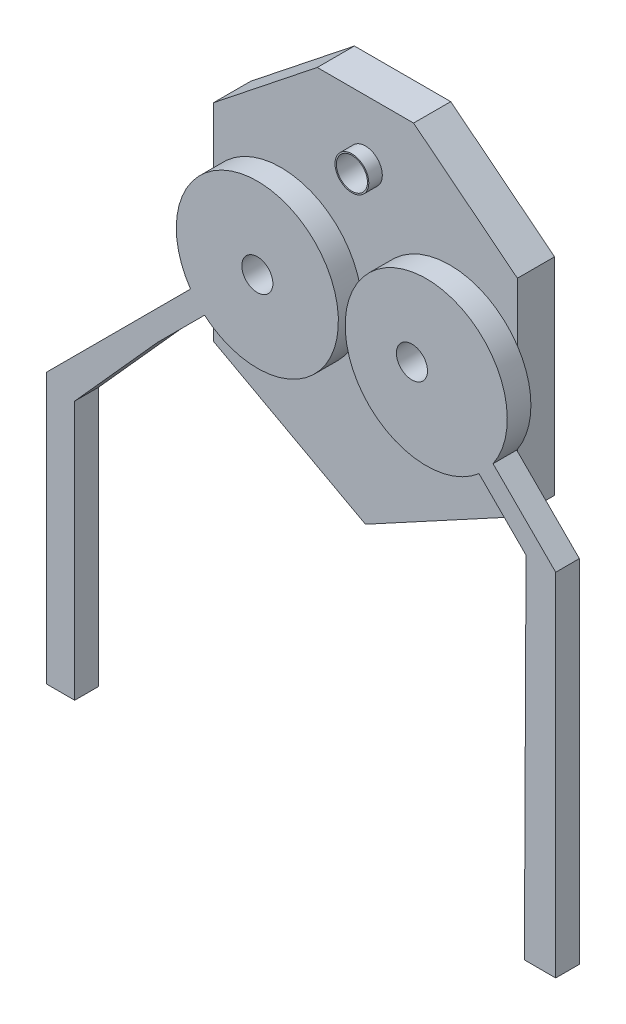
ISO-10303-21;
HEADER;
FILE_DESCRIPTION(('STEP AP214'),'2;1');
FILE_NAME('part.step','',(''),(''),'','','');
FILE_SCHEMA(('AUTOMOTIVE_DESIGN { 1 0 10303 214 1 1 1 1 }'));
ENDSEC;
DATA;
#1=APPLICATION_CONTEXT('core data for automotive mechanical design processes');
#2=APPLICATION_PROTOCOL_DEFINITION('international standard','automotive_design',2000,#1);
#3=PRODUCT_CONTEXT('',#1,'mechanical');
#4=PRODUCT('Part','Part','',(#3));
#5=PRODUCT_RELATED_PRODUCT_CATEGORY('part','',(#4));
#6=PRODUCT_DEFINITION_FORMATION('','',#4);
#7=PRODUCT_DEFINITION_CONTEXT('part definition',#1,'design');
#8=PRODUCT_DEFINITION('design','',#6,#7);
#9=PRODUCT_DEFINITION_SHAPE('','',#8);
#10=(LENGTH_UNIT() NAMED_UNIT(*) SI_UNIT(.MILLI.,.METRE.));
#11=(NAMED_UNIT(*) PLANE_ANGLE_UNIT() SI_UNIT($,.RADIAN.));
#12=(NAMED_UNIT(*) SI_UNIT($,.STERADIAN.) SOLID_ANGLE_UNIT());
#13=UNCERTAINTY_MEASURE_WITH_UNIT(LENGTH_MEASURE(1.E-05),#10,'distance_accuracy_value','');
#14=(GEOMETRIC_REPRESENTATION_CONTEXT(3) GLOBAL_UNCERTAINTY_ASSIGNED_CONTEXT((#13)) GLOBAL_UNIT_ASSIGNED_CONTEXT((#10,
#11,#12)) REPRESENTATION_CONTEXT('',''));
#15=CARTESIAN_POINT('',(0.,0.,0.));
#16=DIRECTION('',(0.,0.,1.));
#17=DIRECTION('',(1.,0.,0.));
#18=AXIS2_PLACEMENT_3D('',#15,#16,#17);
#19=CARTESIAN_POINT('',(0.,-27.5,-11.9622419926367));
#20=DIRECTION('',(0.476874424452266,0.878971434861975,0.));
#21=DIRECTION('',(0.,0.,-1.));
#22=AXIS2_PLACEMENT_3D('',#19,#20,#21);
#23=PLANE('',#22);
#24=DIRECTION('',(0.,0.,1.));
#25=VECTOR('',#24,1.);
#26=CARTESIAN_POINT('',(0.,-27.5,-11.9622419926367));
#27=LINE('',#26,#25);
#28=CARTESIAN_POINT('',(0.,-27.5,-5.5));
#29=VERTEX_POINT('',#28);
#30=CARTESIAN_POINT('',(0.,-27.5,0.));
#31=VERTEX_POINT('',#30);
#32=EDGE_CURVE('E10',#29,#31,#27,.T.);
#33=ORIENTED_EDGE('',*,*,#32,.T.);
#34=DIRECTION('',(-0.878971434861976,0.476874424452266,0.));
#35=VECTOR('',#34,1.);
#36=CARTESIAN_POINT('',(0.,-27.5,0.));
#37=LINE('',#36,#35);
#38=CARTESIAN_POINT('',(-22.5,-15.2929200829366,0.));
#39=VERTEX_POINT('',#38);
#40=EDGE_CURVE('E439',#31,#39,#37,.T.);
#41=ORIENTED_EDGE('',*,*,#40,.T.);
#42=DIRECTION('',(0.,0.,1.));
#43=VECTOR('',#42,1.);
#44=CARTESIAN_POINT('',(-22.5,-15.2929200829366,-26.537467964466));
#45=LINE('',#44,#43);
#46=CARTESIAN_POINT('',(-22.5,-15.2929200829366,-5.5));
#47=VERTEX_POINT('',#46);
#48=EDGE_CURVE('E576',#47,#39,#45,.T.);
#49=ORIENTED_EDGE('',*,*,#48,.F.);
#50=DIRECTION('',(-0.878971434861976,0.476874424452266,0.));
#51=VECTOR('',#50,1.);
#52=CARTESIAN_POINT('',(-11.5268724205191,-21.2462465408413,-5.5));
#53=LINE('',#52,#51);
#54=EDGE_CURVE('E397',#29,#47,#53,.T.);
#55=ORIENTED_EDGE('',*,*,#54,.F.);
#56=EDGE_LOOP('',(#33,#41,#49,#55));
#57=FACE_BOUND('',#56,.T.);
#58=ADVANCED_FACE('F15',(#57),#23,.F.);
#59=CARTESIAN_POINT('',(0.,-27.5,-11.9622419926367));
#60=DIRECTION('',(0.476874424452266,-0.878971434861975,0.));
#61=DIRECTION('',(0.,0.,-1.));
#62=AXIS2_PLACEMENT_3D('',#59,#60,#61);
#63=PLANE('',#62);
#64=DIRECTION('',(0.878971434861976,0.476874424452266,0.));
#65=VECTOR('',#64,1.);
#66=CARTESIAN_POINT('',(11.5268724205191,-21.2462465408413,-5.5));
#67=LINE('',#66,#65);
#68=CARTESIAN_POINT('',(22.5,-15.2929200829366,-5.5));
#69=VERTEX_POINT('',#68);
#70=EDGE_CURVE('E354',#29,#69,#67,.T.);
#71=ORIENTED_EDGE('',*,*,#70,.T.);
#72=DIRECTION('',(0.,0.,1.));
#73=VECTOR('',#72,1.);
#74=CARTESIAN_POINT('',(22.5,-15.2929200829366,-26.537467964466));
#75=LINE('',#74,#73);
#76=CARTESIAN_POINT('',(22.5,-15.2929200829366,0.));
#77=VERTEX_POINT('',#76);
#78=EDGE_CURVE('E372',#69,#77,#75,.T.);
#79=ORIENTED_EDGE('',*,*,#78,.T.);
#80=DIRECTION('',(0.878971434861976,0.476874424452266,0.));
#81=VECTOR('',#80,1.);
#82=CARTESIAN_POINT('',(0.,-27.5,0.));
#83=LINE('',#82,#81);
#84=EDGE_CURVE('E443',#31,#77,#83,.T.);
#85=ORIENTED_EDGE('',*,*,#84,.F.);
#86=ORIENTED_EDGE('',*,*,#32,.F.);
#87=EDGE_LOOP('',(#71,#79,#85,#86));
#88=FACE_BOUND('',#87,.T.);
#89=ADVANCED_FACE('F738',(#88),#63,.T.);
#90=CARTESIAN_POINT('',(12.5,0.,3.5));
#91=DIRECTION('',(0.,0.,-1.));
#92=DIRECTION('',(0.,-1.,0.));
#93=AXIS2_PLACEMENT_3D('',#90,#91,#92);
#94=PLANE('',#93);
#95=DIRECTION('',(0.00471580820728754,0.999988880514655,0.));
#96=VECTOR('',#95,1.);
#97=CARTESIAN_POINT('',(27.0316556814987,-68.0875594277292,3.5));
#98=LINE('',#97,#96);
#99=CARTESIAN_POINT('',(27.0316556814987,-68.0875594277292,3.5));
#100=VERTEX_POINT('',#99);
#101=CARTESIAN_POINT('',(27.2769785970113,-16.0667441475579,3.5));
#102=VERTEX_POINT('',#101);
#103=EDGE_CURVE('E329',#100,#102,#98,.T.);
#104=ORIENTED_EDGE('',*,*,#103,.F.);
#105=DIRECTION('',(-1.,0.,0.));
#106=VECTOR('',#105,1.);
#107=CARTESIAN_POINT('',(31.6696264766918,-68.0875594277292,3.5));
#108=LINE('',#107,#106);
#109=CARTESIAN_POINT('',(31.6696264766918,-68.0875594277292,3.5));
#110=VERTEX_POINT('',#109);
#111=EDGE_CURVE('E26',#110,#100,#108,.T.);
#112=ORIENTED_EDGE('',*,*,#111,.F.);
#113=DIRECTION('',(0.,-1.,0.));
#114=VECTOR('',#113,1.);
#115=CARTESIAN_POINT('',(31.6696264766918,-16.0667441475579,3.5));
#116=LINE('',#115,#114);
#117=CARTESIAN_POINT('',(31.6696264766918,-16.0667441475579,3.5));
#118=VERTEX_POINT('',#117);
#119=EDGE_CURVE('E523',#118,#110,#116,.T.);
#120=ORIENTED_EDGE('',*,*,#119,.F.);
#121=DIRECTION('',(0.707106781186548,-0.707106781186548,0.));
#122=VECTOR('',#121,1.);
#123=CARTESIAN_POINT('',(31.6696264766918,-16.0667441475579,3.5));
#124=LINE('',#123,#122);
#125=CARTESIAN_POINT('',(22.3936848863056,-6.79080255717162,3.5));
#126=VERTEX_POINT('',#125);
#127=EDGE_CURVE('E302',#126,#118,#124,.T.);
#128=ORIENTED_EDGE('',*,*,#127,.F.);
#129=CARTESIAN_POINT('',(12.5,0.,3.5));
#130=DIRECTION('',(0.,0.,-1.));
#131=DIRECTION('',(0.,1.,0.));
#132=AXIS2_PLACEMENT_3D('',#129,#130,#131);
#133=CIRCLE('',#132,12.);
#134=CARTESIAN_POINT('',(20.3158575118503,-9.10562306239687,3.5));
#135=VERTEX_POINT('',#134);
#136=EDGE_CURVE('E294',#135,#126,#133,.T.);
#137=ORIENTED_EDGE('',*,*,#136,.F.);
#138=DIRECTION('',(-0.707106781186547,0.707106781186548,0.));
#139=VECTOR('',#138,1.);
#140=CARTESIAN_POINT('',(27.2769785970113,-16.0667441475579,3.5));
#141=LINE('',#140,#139);
#142=EDGE_CURVE('E299',#102,#135,#141,.T.);
#143=ORIENTED_EDGE('',*,*,#142,.F.);
#144=EDGE_LOOP('',(#104,#112,#120,#128,#137,#143));
#145=FACE_BOUND('',#144,.T.);
#146=CARTESIAN_POINT('',(10.3880983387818,0.246417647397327,3.5));
#147=DIRECTION('',(0.,0.,-1.));
#148=DIRECTION('',(1.,0.,0.));
#149=AXIS2_PLACEMENT_3D('',#146,#147,#148);
#150=CIRCLE('',#149,2.3);
#151=CARTESIAN_POINT('',(12.6880983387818,0.246417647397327,3.5));
#152=VERTEX_POINT('',#151);
#153=EDGE_CURVE('E19',#152,#152,#150,.T.);
#154=ORIENTED_EDGE('',*,*,#153,.T.);
#155=EDGE_LOOP('',(#154));
#156=FACE_BOUND('',#155,.T.);
#157=ADVANCED_FACE('F296',(#145,#156),#94,.F.);
#158=CARTESIAN_POINT('',(31.6696264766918,-68.0875594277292,3.5));
#159=DIRECTION('',(0.,-1.,0.));
#160=DIRECTION('',(0.,0.,-1.));
#161=AXIS2_PLACEMENT_3D('',#158,#159,#160);
#162=PLANE('',#161);
#163=DIRECTION('',(-1.,0.,0.));
#164=VECTOR('',#163,1.);
#165=CARTESIAN_POINT('',(31.6696264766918,-68.0875594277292,0.));
#166=LINE('',#165,#164);
#167=CARTESIAN_POINT('',(31.6696264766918,-68.0875594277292,0.));
#168=VERTEX_POINT('',#167);
#169=CARTESIAN_POINT('',(27.0316556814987,-68.0875594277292,0.));
#170=VERTEX_POINT('',#169);
#171=EDGE_CURVE('E339',#168,#170,#166,.T.);
#172=ORIENTED_EDGE('',*,*,#171,.F.);
#173=DIRECTION('',(0.,0.,-1.));
#174=VECTOR('',#173,1.);
#175=CARTESIAN_POINT('',(31.6696264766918,-68.0875594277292,3.5));
#176=LINE('',#175,#174);
#177=EDGE_CURVE('E527',#110,#168,#176,.T.);
#178=ORIENTED_EDGE('',*,*,#177,.F.);
#179=ORIENTED_EDGE('',*,*,#111,.T.);
#180=DIRECTION('',(0.,0.,-1.));
#181=VECTOR('',#180,1.);
#182=CARTESIAN_POINT('',(27.0316556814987,-68.0875594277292,3.5));
#183=LINE('',#182,#181);
#184=EDGE_CURVE('E367',#100,#170,#183,.T.);
#185=ORIENTED_EDGE('',*,*,#184,.T.);
#186=EDGE_LOOP('',(#172,#178,#179,#185));
#187=FACE_BOUND('',#186,.T.);
#188=ADVANCED_FACE('F817',(#187),#162,.T.);
#189=CARTESIAN_POINT('',(31.6696264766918,-16.0667441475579,3.5));
#190=DIRECTION('',(1.,0.,0.));
#191=DIRECTION('',(0.,1.,0.));
#192=AXIS2_PLACEMENT_3D('',#189,#190,#191);
#193=PLANE('',#192);
#194=DIRECTION('',(0.,-1.,0.));
#195=VECTOR('',#194,1.);
#196=CARTESIAN_POINT('',(31.6696264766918,-16.0667441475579,0.));
#197=LINE('',#196,#195);
#198=CARTESIAN_POINT('',(31.6696264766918,-16.0667441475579,0.));
#199=VERTEX_POINT('',#198);
#200=EDGE_CURVE('E461',#199,#168,#197,.T.);
#201=ORIENTED_EDGE('',*,*,#200,.F.);
#202=DIRECTION('',(0.,0.,-1.));
#203=VECTOR('',#202,1.);
#204=CARTESIAN_POINT('',(31.6696264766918,-16.0667441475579,3.5));
#205=LINE('',#204,#203);
#206=EDGE_CURVE('E528',#118,#199,#205,.T.);
#207=ORIENTED_EDGE('',*,*,#206,.F.);
#208=ORIENTED_EDGE('',*,*,#119,.T.);
#209=ORIENTED_EDGE('',*,*,#177,.T.);
#210=EDGE_LOOP('',(#201,#207,#208,#209));
#211=FACE_BOUND('',#210,.T.);
#212=ADVANCED_FACE('F815',(#211),#193,.T.);
#213=CARTESIAN_POINT('',(31.6696264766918,-16.0667441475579,3.5));
#214=DIRECTION('',(0.707106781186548,0.707106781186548,0.));
#215=DIRECTION('',(0.,0.,-1.));
#216=AXIS2_PLACEMENT_3D('',#213,#214,#215);
#217=PLANE('',#216);
#218=DIRECTION('',(0.707106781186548,-0.707106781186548,0.));
#219=VECTOR('',#218,1.);
#220=CARTESIAN_POINT('',(31.6696264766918,-16.0667441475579,0.));
#221=LINE('',#220,#219);
#222=CARTESIAN_POINT('',(22.3936848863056,-6.79080255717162,0.));
#223=VERTEX_POINT('',#222);
#224=CARTESIAN_POINT('',(22.5,-6.89711767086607,0.));
#225=VERTEX_POINT('',#224);
#226=EDGE_CURVE('E473',#223,#225,#221,.T.);
#227=ORIENTED_EDGE('',*,*,#226,.F.);
#228=DIRECTION('',(0.,0.,-1.));
#229=VECTOR('',#228,1.);
#230=CARTESIAN_POINT('',(22.3936848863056,-6.79080255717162,3.5));
#231=LINE('',#230,#229);
#232=EDGE_CURVE('E306',#126,#223,#231,.T.);
#233=ORIENTED_EDGE('',*,*,#232,.F.);
#234=ORIENTED_EDGE('',*,*,#127,.T.);
#235=ORIENTED_EDGE('',*,*,#206,.T.);
#236=DIRECTION('',(0.707106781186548,-0.707106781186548,0.));
#237=VECTOR('',#236,1.);
#238=CARTESIAN_POINT('',(31.6696264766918,-16.0667441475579,0.));
#239=LINE('',#238,#237);
#240=EDGE_CURVE('E457',#225,#199,#239,.T.);
#241=ORIENTED_EDGE('',*,*,#240,.F.);
#242=EDGE_LOOP('',(#227,#233,#234,#235,#241));
#243=FACE_BOUND('',#242,.T.);
#244=ADVANCED_FACE('F811',(#243),#217,.T.);
#245=CARTESIAN_POINT('',(12.5,0.,3.5));
#246=DIRECTION('',(0.,0.,-1.));
#247=DIRECTION('',(-1.,0.,0.));
#248=AXIS2_PLACEMENT_3D('',#245,#246,#247);
#249=CYLINDRICAL_SURFACE('',#248,12.);
#250=CARTESIAN_POINT('',(12.5,0.,0.));
#251=DIRECTION('',(0.,0.,-1.));
#252=DIRECTION('',(0.,1.,0.));
#253=AXIS2_PLACEMENT_3D('',#250,#251,#252);
#254=CIRCLE('',#253,12.);
#255=CARTESIAN_POINT('',(20.3158575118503,-9.10562306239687,0.));
#256=VERTEX_POINT('',#255);
#257=CARTESIAN_POINT('',(22.5,6.63324958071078,0.));
#258=VERTEX_POINT('',#257);
#259=EDGE_CURVE('E312',#256,#258,#254,.T.);
#260=ORIENTED_EDGE('',*,*,#259,.F.);
#261=DIRECTION('',(0.,0.,-1.));
#262=VECTOR('',#261,1.);
#263=CARTESIAN_POINT('',(20.3158575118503,-9.10562306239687,3.5));
#264=LINE('',#263,#262);
#265=EDGE_CURVE('E307',#135,#256,#264,.T.);
#266=ORIENTED_EDGE('',*,*,#265,.F.);
#267=ORIENTED_EDGE('',*,*,#136,.T.);
#268=ORIENTED_EDGE('',*,*,#232,.T.);
#269=CARTESIAN_POINT('',(12.5,0.,0.));
#270=DIRECTION('',(0.,0.,-1.));
#271=DIRECTION('',(0.,1.,0.));
#272=AXIS2_PLACEMENT_3D('',#269,#270,#271);
#273=CIRCLE('',#272,12.);
#274=CARTESIAN_POINT('',(22.5,-6.63324958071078,0.));
#275=VERTEX_POINT('',#274);
#276=EDGE_CURVE('E448',#275,#223,#273,.T.);
#277=ORIENTED_EDGE('',*,*,#276,.F.);
#278=CARTESIAN_POINT('',(12.5,0.,0.));
#279=DIRECTION('',(0.,0.,-1.));
#280=DIRECTION('',(0.,1.,0.));
#281=AXIS2_PLACEMENT_3D('',#278,#279,#280);
#282=CIRCLE('',#281,12.);
#283=EDGE_CURVE('E338',#258,#275,#282,.T.);
#284=ORIENTED_EDGE('',*,*,#283,.F.);
#285=EDGE_LOOP('',(#260,#266,#267,#268,#277,#284));
#286=FACE_BOUND('',#285,.T.);
#287=ADVANCED_FACE('F310',(#286),#249,.T.);
#288=CARTESIAN_POINT('',(27.2769785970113,-16.0667441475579,3.5));
#289=DIRECTION('',(-0.707106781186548,-0.707106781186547,0.));
#290=DIRECTION('',(-0.707106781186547,0.707106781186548,0.));
#291=AXIS2_PLACEMENT_3D('',#288,#289,#290);
#292=PLANE('',#291);
#293=DIRECTION('',(-0.707106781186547,0.707106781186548,0.));
#294=VECTOR('',#293,1.);
#295=CARTESIAN_POINT('',(27.2769785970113,-16.0667441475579,0.));
#296=LINE('',#295,#294);
#297=CARTESIAN_POINT('',(27.2769785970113,-16.0667441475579,0.));
#298=VERTEX_POINT('',#297);
#299=CARTESIAN_POINT('',(22.5,-11.2897655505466,0.));
#300=VERTEX_POINT('',#299);
#301=EDGE_CURVE('E462',#298,#300,#296,.T.);
#302=ORIENTED_EDGE('',*,*,#301,.F.);
#303=DIRECTION('',(0.,0.,-1.));
#304=VECTOR('',#303,1.);
#305=CARTESIAN_POINT('',(27.2769785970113,-16.0667441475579,3.5));
#306=LINE('',#305,#304);
#307=EDGE_CURVE('E321',#102,#298,#306,.T.);
#308=ORIENTED_EDGE('',*,*,#307,.F.);
#309=ORIENTED_EDGE('',*,*,#142,.T.);
#310=ORIENTED_EDGE('',*,*,#265,.T.);
#311=DIRECTION('',(-0.707106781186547,0.707106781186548,0.));
#312=VECTOR('',#311,1.);
#313=CARTESIAN_POINT('',(27.2769785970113,-16.0667441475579,0.));
#314=LINE('',#313,#312);
#315=EDGE_CURVE('E412',#300,#256,#314,.T.);
#316=ORIENTED_EDGE('',*,*,#315,.F.);
#317=EDGE_LOOP('',(#302,#308,#309,#310,#316));
#318=FACE_BOUND('',#317,.T.);
#319=ADVANCED_FACE('F319',(#318),#292,.T.);
#320=CARTESIAN_POINT('',(27.0316556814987,-68.0875594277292,3.5));
#321=DIRECTION('',(-0.999988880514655,0.00471580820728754,0.));
#322=DIRECTION('',(0.,0.,1.));
#323=AXIS2_PLACEMENT_3D('',#320,#321,#322);
#324=PLANE('',#323);
#325=DIRECTION('',(0.00471580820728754,0.999988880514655,0.));
#326=VECTOR('',#325,1.);
#327=CARTESIAN_POINT('',(27.0316556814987,-68.0875594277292,0.));
#328=LINE('',#327,#326);
#329=EDGE_CURVE('E334',#170,#298,#328,.T.);
#330=ORIENTED_EDGE('',*,*,#329,.F.);
#331=ORIENTED_EDGE('',*,*,#184,.F.);
#332=ORIENTED_EDGE('',*,*,#103,.T.);
#333=ORIENTED_EDGE('',*,*,#307,.T.);
#334=EDGE_LOOP('',(#330,#331,#332,#333));
#335=FACE_BOUND('',#334,.T.);
#336=ADVANCED_FACE('F17',(#335),#324,.T.);
#337=CARTESIAN_POINT('',(12.5,0.,0.));
#338=DIRECTION('',(0.,0.,-1.));
#339=DIRECTION('',(0.,-1.,0.));
#340=AXIS2_PLACEMENT_3D('',#337,#338,#339);
#341=PLANE('',#340);
#342=CARTESIAN_POINT('',(10.3880983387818,0.246417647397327,0.));
#343=DIRECTION('',(0.,0.,-1.));
#344=DIRECTION('',(1.,0.,0.));
#345=AXIS2_PLACEMENT_3D('',#342,#343,#344);
#346=CIRCLE('',#345,2.3);
#347=CARTESIAN_POINT('',(12.5346048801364,1.07255908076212,0.));
#348=VERTEX_POINT('',#347);
#349=CARTESIAN_POINT('',(8.35349345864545,-0.826141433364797,0.));
#350=VERTEX_POINT('',#349);
#351=EDGE_CURVE('E388',#348,#350,#346,.T.);
#352=ORIENTED_EDGE('',*,*,#351,.F.);
#353=CARTESIAN_POINT('',(10.5,0.,0.));
#354=DIRECTION('',(0.,0.,-1.));
#355=DIRECTION('',(1.,0.,0.));
#356=AXIS2_PLACEMENT_3D('',#353,#354,#355);
#357=CIRCLE('',#356,2.3);
#358=EDGE_CURVE('E474',#348,#350,#357,.T.);
#359=ORIENTED_EDGE('',*,*,#358,.T.);
#360=EDGE_LOOP('',(#352,#359));
#361=FACE_BOUND('',#360,.T.);
#362=ADVANCED_FACE('F842',(#361),#341,.T.);
#363=CARTESIAN_POINT('',(12.5,0.,0.));
#364=DIRECTION('',(0.,0.,-1.));
#365=DIRECTION('',(0.,-1.,0.));
#366=AXIS2_PLACEMENT_3D('',#363,#364,#365);
#367=PLANE('',#366);
#368=ORIENTED_EDGE('',*,*,#283,.T.);
#369=DIRECTION('',(0.,1.,0.));
#370=VECTOR('',#369,1.);
#371=CARTESIAN_POINT('',(22.5,-27.5,0.));
#372=LINE('',#371,#370);
#373=EDGE_CURVE('E371',#275,#258,#372,.T.);
#374=ORIENTED_EDGE('',*,*,#373,.T.);
#375=EDGE_LOOP('',(#368,#374));
#376=FACE_BOUND('',#375,.T.);
#377=ADVANCED_FACE('F845',(#376),#367,.T.);
#378=CARTESIAN_POINT('',(12.5,0.,0.));
#379=DIRECTION('',(0.,0.,-1.));
#380=DIRECTION('',(0.,-1.,0.));
#381=AXIS2_PLACEMENT_3D('',#378,#379,#380);
#382=PLANE('',#381);
#383=ORIENTED_EDGE('',*,*,#301,.T.);
#384=DIRECTION('',(0.,1.,0.));
#385=VECTOR('',#384,1.);
#386=CARTESIAN_POINT('',(22.5,-27.5,0.));
#387=LINE('',#386,#385);
#388=EDGE_CURVE('E463',#300,#225,#387,.T.);
#389=ORIENTED_EDGE('',*,*,#388,.T.);
#390=ORIENTED_EDGE('',*,*,#240,.T.);
#391=ORIENTED_EDGE('',*,*,#200,.T.);
#392=ORIENTED_EDGE('',*,*,#171,.T.);
#393=ORIENTED_EDGE('',*,*,#329,.T.);
#394=EDGE_LOOP('',(#383,#389,#390,#391,#392,#393));
#395=FACE_BOUND('',#394,.T.);
#396=ADVANCED_FACE('F784',(#395),#382,.T.);
#397=CARTESIAN_POINT('',(12.5,0.,0.));
#398=DIRECTION('',(0.,0.,-1.));
#399=DIRECTION('',(0.,-1.,0.));
#400=AXIS2_PLACEMENT_3D('',#397,#398,#399);
#401=PLANE('',#400);
#402=CARTESIAN_POINT('',(19.6896963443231,0.,0.));
#403=DIRECTION('',(0.,0.,-1.));
#404=DIRECTION('',(1.,0.,0.));
#405=AXIS2_PLACEMENT_3D('',#402,#403,#404);
#406=CIRCLE('',#405,1.);
#407=CARTESIAN_POINT('',(20.6896963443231,0.,0.));
#408=VERTEX_POINT('',#407);
#409=EDGE_CURVE('E532',#408,#408,#406,.T.);
#410=ORIENTED_EDGE('',*,*,#409,.T.);
#411=EDGE_LOOP('',(#410));
#412=FACE_BOUND('',#411,.T.);
#413=ADVANCED_FACE('F889',(#412),#401,.T.);
#414=CARTESIAN_POINT('',(-12.5,0.,0.));
#415=DIRECTION('',(0.,0.,1.));
#416=DIRECTION('',(1.,0.,0.));
#417=AXIS2_PLACEMENT_3D('',#414,#415,#416);
#418=PLANE('',#417);
#419=DIRECTION('',(-0.707106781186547,-0.707106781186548,0.));
#420=VECTOR('',#419,1.);
#421=CARTESIAN_POINT('',(-31.6696264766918,-16.0667441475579,0.));
#422=LINE('',#421,#420);
#423=CARTESIAN_POINT('',(-22.5,-6.89711767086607,0.));
#424=VERTEX_POINT('',#423);
#425=CARTESIAN_POINT('',(-43.6904417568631,-28.0875594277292,0.));
#426=VERTEX_POINT('',#425);
#427=EDGE_CURVE('E411',#424,#426,#422,.T.);
#428=ORIENTED_EDGE('',*,*,#427,.F.);
#429=DIRECTION('',(0.,-1.,0.));
#430=VECTOR('',#429,1.);
#431=CARTESIAN_POINT('',(-22.5,27.5,0.));
#432=LINE('',#431,#430);
#433=CARTESIAN_POINT('',(-22.5,-11.2897655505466,0.));
#434=VERTEX_POINT('',#433);
#435=EDGE_CURVE('E574',#424,#434,#432,.T.);
#436=ORIENTED_EDGE('',*,*,#435,.T.);
#437=DIRECTION('',(0.707106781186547,0.707106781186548,0.));
#438=VECTOR('',#437,1.);
#439=CARTESIAN_POINT('',(-27.2769785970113,-16.0667441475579,0.));
#440=LINE('',#439,#438);
#441=CARTESIAN_POINT('',(-27.2769785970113,-16.0667441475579,0.));
#442=VERTEX_POINT('',#441);
#443=EDGE_CURVE('E279',#442,#434,#440,.T.);
#444=ORIENTED_EDGE('',*,*,#443,.F.);
#445=DIRECTION('',(0.667952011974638,0.744204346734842,0.));
#446=VECTOR('',#445,1.);
#447=CARTESIAN_POINT('',(-27.2769785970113,-16.0667441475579,0.));
#448=LINE('',#447,#446);
#449=CARTESIAN_POINT('',(-39.5380625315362,-29.7275338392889,0.));
#450=VERTEX_POINT('',#449);
#451=EDGE_CURVE('E517',#450,#442,#448,.T.);
#452=ORIENTED_EDGE('',*,*,#451,.F.);
#453=DIRECTION('',(0.,1.,0.));
#454=VECTOR('',#453,1.);
#455=CARTESIAN_POINT('',(-39.5380625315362,-29.7275338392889,0.));
#456=LINE('',#455,#454);
#457=CARTESIAN_POINT('',(-39.5380625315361,-68.0875594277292,0.));
#458=VERTEX_POINT('',#457);
#459=EDGE_CURVE('E433',#458,#450,#456,.T.);
#460=ORIENTED_EDGE('',*,*,#459,.F.);
#461=DIRECTION('',(1.,0.,0.));
#462=VECTOR('',#461,1.);
#463=CARTESIAN_POINT('',(-39.5380625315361,-68.0875594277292,0.));
#464=LINE('',#463,#462);
#465=CARTESIAN_POINT('',(-43.6904417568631,-68.0875594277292,0.));
#466=VERTEX_POINT('',#465);
#467=EDGE_CURVE('E383',#466,#458,#464,.T.);
#468=ORIENTED_EDGE('',*,*,#467,.F.);
#469=DIRECTION('',(0.,-1.,0.));
#470=VECTOR('',#469,1.);
#471=CARTESIAN_POINT('',(-43.6904417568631,-28.0875594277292,0.));
#472=LINE('',#471,#470);
#473=EDGE_CURVE('E453',#426,#466,#472,.T.);
#474=ORIENTED_EDGE('',*,*,#473,.F.);
#475=EDGE_LOOP('',(#428,#436,#444,#452,#460,#468,#474));
#476=FACE_BOUND('',#475,.T.);
#477=ADVANCED_FACE('F949',(#476),#418,.F.);
#478=CARTESIAN_POINT('',(-12.5,0.,3.5));
#479=DIRECTION('',(0.,0.,1.));
#480=DIRECTION('',(1.,0.,0.));
#481=AXIS2_PLACEMENT_3D('',#478,#479,#480);
#482=PLANE('',#481);
#483=DIRECTION('',(0.667952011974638,0.744204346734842,0.));
#484=VECTOR('',#483,1.);
#485=CARTESIAN_POINT('',(-27.2769785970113,-16.0667441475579,3.5));
#486=LINE('',#485,#484);
#487=CARTESIAN_POINT('',(-39.5380625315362,-29.7275338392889,3.5));
#488=VERTEX_POINT('',#487);
#489=CARTESIAN_POINT('',(-27.2769785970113,-16.0667441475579,3.5));
#490=VERTEX_POINT('',#489);
#491=EDGE_CURVE('E359',#488,#490,#486,.T.);
#492=ORIENTED_EDGE('',*,*,#491,.T.);
#493=DIRECTION('',(0.707106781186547,0.707106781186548,0.));
#494=VECTOR('',#493,1.);
#495=CARTESIAN_POINT('',(-27.2769785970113,-16.0667441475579,3.5));
#496=LINE('',#495,#494);
#497=CARTESIAN_POINT('',(-20.3158575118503,-9.10562306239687,3.5));
#498=VERTEX_POINT('',#497);
#499=EDGE_CURVE('E268',#490,#498,#496,.T.);
#500=ORIENTED_EDGE('',*,*,#499,.T.);
#501=CARTESIAN_POINT('',(-12.5,0.,3.5));
#502=DIRECTION('',(0.,0.,1.));
#503=DIRECTION('',(-1.,0.,0.));
#504=AXIS2_PLACEMENT_3D('',#501,#502,#503);
#505=CIRCLE('',#504,12.);
#506=CARTESIAN_POINT('',(-22.3936848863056,-6.79080255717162,3.5));
#507=VERTEX_POINT('',#506);
#508=EDGE_CURVE('E677',#498,#507,#505,.T.);
#509=ORIENTED_EDGE('',*,*,#508,.T.);
#510=DIRECTION('',(-0.707106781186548,-0.707106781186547,0.));
#511=VECTOR('',#510,1.);
#512=CARTESIAN_POINT('',(-31.6696264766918,-16.0667441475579,3.5));
#513=LINE('',#512,#511);
#514=CARTESIAN_POINT('',(-43.6904417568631,-28.0875594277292,3.5));
#515=VERTEX_POINT('',#514);
#516=EDGE_CURVE('E410',#507,#515,#513,.T.);
#517=ORIENTED_EDGE('',*,*,#516,.T.);
#518=DIRECTION('',(0.,-1.,0.));
#519=VECTOR('',#518,1.);
#520=CARTESIAN_POINT('',(-43.6904417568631,-28.0875594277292,3.5));
#521=LINE('',#520,#519);
#522=CARTESIAN_POINT('',(-43.6904417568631,-68.0875594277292,3.5));
#523=VERTEX_POINT('',#522);
#524=EDGE_CURVE('E379',#515,#523,#521,.T.);
#525=ORIENTED_EDGE('',*,*,#524,.T.);
#526=DIRECTION('',(1.,0.,0.));
#527=VECTOR('',#526,1.);
#528=CARTESIAN_POINT('',(-39.5380625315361,-68.0875594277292,3.5));
#529=LINE('',#528,#527);
#530=CARTESIAN_POINT('',(-39.5380625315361,-68.0875594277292,3.5));
#531=VERTEX_POINT('',#530);
#532=EDGE_CURVE('E429',#523,#531,#529,.T.);
#533=ORIENTED_EDGE('',*,*,#532,.T.);
#534=DIRECTION('',(0.,1.,0.));
#535=VECTOR('',#534,1.);
#536=CARTESIAN_POINT('',(-39.5380625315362,-29.7275338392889,3.5));
#537=LINE('',#536,#535);
#538=EDGE_CURVE('E564',#531,#488,#537,.T.);
#539=ORIENTED_EDGE('',*,*,#538,.T.);
#540=EDGE_LOOP('',(#492,#500,#509,#517,#525,#533,#539));
#541=FACE_BOUND('',#540,.T.);
#542=CARTESIAN_POINT('',(-12.5,0.,3.5));
#543=DIRECTION('',(0.,0.,-1.));
#544=DIRECTION('',(1.,0.,0.));
#545=AXIS2_PLACEMENT_3D('',#542,#543,#544);
#546=CIRCLE('',#545,2.3);
#547=CARTESIAN_POINT('',(-10.2,0.,3.5));
#548=VERTEX_POINT('',#547);
#549=EDGE_CURVE('E434',#548,#548,#546,.T.);
#550=ORIENTED_EDGE('',*,*,#549,.T.);
#551=EDGE_LOOP('',(#550));
#552=FACE_BOUND('',#551,.T.);
#553=ADVANCED_FACE('F840',(#541,#552),#482,.T.);
#554=CARTESIAN_POINT('',(-39.5380625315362,-29.7275338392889,3.5));
#555=DIRECTION('',(-1.,0.,0.));
#556=DIRECTION('',(0.,1.,0.));
#557=AXIS2_PLACEMENT_3D('',#554,#555,#556);
#558=PLANE('',#557);
#559=ORIENTED_EDGE('',*,*,#459,.T.);
#560=DIRECTION('',(0.,0.,-1.));
#561=VECTOR('',#560,1.);
#562=CARTESIAN_POINT('',(-39.5380625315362,-29.7275338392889,3.5));
#563=LINE('',#562,#561);
#564=EDGE_CURVE('E343',#488,#450,#563,.T.);
#565=ORIENTED_EDGE('',*,*,#564,.F.);
#566=ORIENTED_EDGE('',*,*,#538,.F.);
#567=DIRECTION('',(0.,0.,-1.));
#568=VECTOR('',#567,1.);
#569=CARTESIAN_POINT('',(-39.5380625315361,-68.0875594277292,3.5));
#570=LINE('',#569,#568);
#571=EDGE_CURVE('E387',#531,#458,#570,.T.);
#572=ORIENTED_EDGE('',*,*,#571,.T.);
#573=EDGE_LOOP('',(#559,#565,#566,#572));
#574=FACE_BOUND('',#573,.T.);
#575=ADVANCED_FACE('F836',(#574),#558,.F.);
#576=CARTESIAN_POINT('',(-39.5380625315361,-68.0875594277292,3.5));
#577=DIRECTION('',(0.,1.,0.));
#578=DIRECTION('',(1.,0.,0.));
#579=AXIS2_PLACEMENT_3D('',#576,#577,#578);
#580=PLANE('',#579);
#581=ORIENTED_EDGE('',*,*,#467,.T.);
#582=ORIENTED_EDGE('',*,*,#571,.F.);
#583=ORIENTED_EDGE('',*,*,#532,.F.);
#584=DIRECTION('',(0.,0.,-1.));
#585=VECTOR('',#584,1.);
#586=CARTESIAN_POINT('',(-43.6904417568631,-68.0875594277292,3.5));
#587=LINE('',#586,#585);
#588=EDGE_CURVE('E333',#523,#466,#587,.T.);
#589=ORIENTED_EDGE('',*,*,#588,.T.);
#590=EDGE_LOOP('',(#581,#582,#583,#589));
#591=FACE_BOUND('',#590,.T.);
#592=ADVANCED_FACE('F839',(#591),#580,.F.);
#593=CARTESIAN_POINT('',(-43.6904417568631,-28.0875594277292,3.5));
#594=DIRECTION('',(1.,0.,0.));
#595=DIRECTION('',(0.,1.,0.));
#596=AXIS2_PLACEMENT_3D('',#593,#594,#595);
#597=PLANE('',#596);
#598=ORIENTED_EDGE('',*,*,#473,.T.);
#599=ORIENTED_EDGE('',*,*,#588,.F.);
#600=ORIENTED_EDGE('',*,*,#524,.F.);
#601=DIRECTION('',(0.,0.,-1.));
#602=VECTOR('',#601,1.);
#603=CARTESIAN_POINT('',(-43.6904417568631,-28.0875594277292,3.5));
#604=LINE('',#603,#602);
#605=EDGE_CURVE('E406',#515,#426,#604,.T.);
#606=ORIENTED_EDGE('',*,*,#605,.T.);
#607=EDGE_LOOP('',(#598,#599,#600,#606));
#608=FACE_BOUND('',#607,.T.);
#609=ADVANCED_FACE('F861',(#608),#597,.F.);
#610=CARTESIAN_POINT('',(-31.6696264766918,-16.0667441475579,3.5));
#611=DIRECTION('',(0.707106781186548,-0.707106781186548,0.));
#612=DIRECTION('',(0.,0.,-1.));
#613=AXIS2_PLACEMENT_3D('',#610,#611,#612);
#614=PLANE('',#613);
#615=DIRECTION('',(-0.707106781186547,-0.707106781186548,0.));
#616=VECTOR('',#615,1.);
#617=CARTESIAN_POINT('',(-31.6696264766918,-16.0667441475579,0.));
#618=LINE('',#617,#616);
#619=CARTESIAN_POINT('',(-22.3936848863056,-6.79080255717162,0.));
#620=VERTEX_POINT('',#619);
#621=EDGE_CURVE('E472',#620,#424,#618,.T.);
#622=ORIENTED_EDGE('',*,*,#621,.T.);
#623=ORIENTED_EDGE('',*,*,#427,.T.);
#624=ORIENTED_EDGE('',*,*,#605,.F.);
#625=ORIENTED_EDGE('',*,*,#516,.F.);
#626=DIRECTION('',(0.,0.,-1.));
#627=VECTOR('',#626,1.);
#628=CARTESIAN_POINT('',(-22.3936848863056,-6.79080255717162,3.5));
#629=LINE('',#628,#627);
#630=EDGE_CURVE('E688',#507,#620,#629,.T.);
#631=ORIENTED_EDGE('',*,*,#630,.T.);
#632=EDGE_LOOP('',(#622,#623,#624,#625,#631));
#633=FACE_BOUND('',#632,.T.);
#634=ADVANCED_FACE('F955',(#633),#614,.F.);
#635=CARTESIAN_POINT('',(-12.5,0.,3.5));
#636=DIRECTION('',(0.,0.,-1.));
#637=DIRECTION('',(-1.,0.,0.));
#638=AXIS2_PLACEMENT_3D('',#635,#636,#637);
#639=CYLINDRICAL_SURFACE('',#638,12.);
#640=CARTESIAN_POINT('',(-12.5,0.,0.));
#641=DIRECTION('',(0.,0.,1.));
#642=DIRECTION('',(-1.,0.,0.));
#643=AXIS2_PLACEMENT_3D('',#640,#641,#642);
#644=CIRCLE('',#643,12.);
#645=CARTESIAN_POINT('',(-20.3158575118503,-9.10562306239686,0.));
#646=VERTEX_POINT('',#645);
#647=CARTESIAN_POINT('',(-22.5,6.63324958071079,0.));
#648=VERTEX_POINT('',#647);
#649=EDGE_CURVE('E428',#646,#648,#644,.T.);
#650=ORIENTED_EDGE('',*,*,#649,.T.);
#651=CARTESIAN_POINT('',(-12.5,0.,0.));
#652=DIRECTION('',(0.,0.,1.));
#653=DIRECTION('',(-1.,0.,0.));
#654=AXIS2_PLACEMENT_3D('',#651,#652,#653);
#655=CIRCLE('',#654,12.);
#656=CARTESIAN_POINT('',(-22.5,-6.63324958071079,0.));
#657=VERTEX_POINT('',#656);
#658=EDGE_CURVE('E522',#648,#657,#655,.T.);
#659=ORIENTED_EDGE('',*,*,#658,.T.);
#660=CARTESIAN_POINT('',(-12.5,0.,0.));
#661=DIRECTION('',(0.,0.,1.));
#662=DIRECTION('',(-1.,0.,0.));
#663=AXIS2_PLACEMENT_3D('',#660,#661,#662);
#664=CIRCLE('',#663,12.);
#665=EDGE_CURVE('E483',#657,#620,#664,.T.);
#666=ORIENTED_EDGE('',*,*,#665,.T.);
#667=ORIENTED_EDGE('',*,*,#630,.F.);
#668=ORIENTED_EDGE('',*,*,#508,.F.);
#669=DIRECTION('',(0.,0.,-1.));
#670=VECTOR('',#669,1.);
#671=CARTESIAN_POINT('',(-20.3158575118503,-9.10562306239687,3.5));
#672=LINE('',#671,#670);
#673=EDGE_CURVE('E342',#498,#646,#672,.T.);
#674=ORIENTED_EDGE('',*,*,#673,.T.);
#675=EDGE_LOOP('',(#650,#659,#666,#667,#668,#674));
#676=FACE_BOUND('',#675,.T.);
#677=ADVANCED_FACE('F963',(#676),#639,.T.);
#678=CARTESIAN_POINT('',(-27.2769785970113,-16.0667441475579,3.5));
#679=DIRECTION('',(-0.707106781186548,0.707106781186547,0.));
#680=DIRECTION('',(0.,0.,1.));
#681=AXIS2_PLACEMENT_3D('',#678,#679,#680);
#682=PLANE('',#681);
#683=ORIENTED_EDGE('',*,*,#443,.T.);
#684=DIRECTION('',(0.707106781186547,0.707106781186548,0.));
#685=VECTOR('',#684,1.);
#686=CARTESIAN_POINT('',(-27.2769785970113,-16.0667441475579,0.));
#687=LINE('',#686,#685);
#688=EDGE_CURVE('E423',#434,#646,#687,.T.);
#689=ORIENTED_EDGE('',*,*,#688,.T.);
#690=ORIENTED_EDGE('',*,*,#673,.F.);
#691=ORIENTED_EDGE('',*,*,#499,.F.);
#692=DIRECTION('',(0.,0.,-1.));
#693=VECTOR('',#692,1.);
#694=CARTESIAN_POINT('',(-27.2769785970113,-16.0667441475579,3.5));
#695=LINE('',#694,#693);
#696=EDGE_CURVE('E521',#490,#442,#695,.T.);
#697=ORIENTED_EDGE('',*,*,#696,.T.);
#698=EDGE_LOOP('',(#683,#689,#690,#691,#697));
#699=FACE_BOUND('',#698,.T.);
#700=ADVANCED_FACE('F1344',(#699),#682,.F.);
#701=CARTESIAN_POINT('',(-27.2769785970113,-16.0667441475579,3.5));
#702=DIRECTION('',(-0.744204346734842,0.667952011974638,0.));
#703=DIRECTION('',(0.,0.,1.));
#704=AXIS2_PLACEMENT_3D('',#701,#702,#703);
#705=PLANE('',#704);
#706=ORIENTED_EDGE('',*,*,#451,.T.);
#707=ORIENTED_EDGE('',*,*,#696,.F.);
#708=ORIENTED_EDGE('',*,*,#491,.F.);
#709=ORIENTED_EDGE('',*,*,#564,.T.);
#710=EDGE_LOOP('',(#706,#707,#708,#709));
#711=FACE_BOUND('',#710,.T.);
#712=ADVANCED_FACE('F930',(#711),#705,.F.);
#713=CARTESIAN_POINT('',(-12.5,0.,0.));
#714=DIRECTION('',(0.,0.,1.));
#715=DIRECTION('',(1.,0.,0.));
#716=AXIS2_PLACEMENT_3D('',#713,#714,#715);
#717=PLANE('',#716);
#718=ORIENTED_EDGE('',*,*,#658,.F.);
#719=DIRECTION('',(0.,-1.,0.));
#720=VECTOR('',#719,1.);
#721=CARTESIAN_POINT('',(-22.5,27.5,0.));
#722=LINE('',#721,#720);
#723=EDGE_CURVE('E401',#648,#657,#722,.T.);
#724=ORIENTED_EDGE('',*,*,#723,.T.);
#725=EDGE_LOOP('',(#718,#724));
#726=FACE_BOUND('',#725,.T.);
#727=ADVANCED_FACE('F886',(#726),#717,.F.);
#728=CARTESIAN_POINT('',(-12.5,0.,0.));
#729=DIRECTION('',(0.,0.,1.));
#730=DIRECTION('',(1.,0.,0.));
#731=AXIS2_PLACEMENT_3D('',#728,#729,#730);
#732=PLANE('',#731);
#733=CARTESIAN_POINT('',(-8.61030365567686,0.,0.));
#734=DIRECTION('',(0.,0.,-1.));
#735=DIRECTION('',(1.,0.,0.));
#736=AXIS2_PLACEMENT_3D('',#733,#734,#735);
#737=CIRCLE('',#736,1.);
#738=CARTESIAN_POINT('',(-7.61030365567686,0.,0.));
#739=VERTEX_POINT('',#738);
#740=EDGE_CURVE('E405',#739,#739,#737,.T.);
#741=ORIENTED_EDGE('',*,*,#740,.T.);
#742=EDGE_LOOP('',(#741));
#743=FACE_BOUND('',#742,.T.);
#744=ADVANCED_FACE('F883',(#743),#732,.F.);
#745=CARTESIAN_POINT('',(0.,18.5,2.));
#746=DIRECTION('',(0.,0.,-1.));
#747=DIRECTION('',(0.,-1.,0.));
#748=AXIS2_PLACEMENT_3D('',#745,#746,#747);
#749=PLANE('',#748);
#750=CARTESIAN_POINT('',(0.,18.5,2.));
#751=DIRECTION('',(0.,0.,-1.));
#752=DIRECTION('',(0.,1.,0.));
#753=AXIS2_PLACEMENT_3D('',#750,#751,#752);
#754=CIRCLE('',#753,2.5);
#755=CARTESIAN_POINT('',(0.,21.,2.));
#756=VERTEX_POINT('',#755);
#757=EDGE_CURVE('E558',#756,#756,#754,.T.);
#758=ORIENTED_EDGE('',*,*,#757,.F.);
#759=EDGE_LOOP('',(#758));
#760=FACE_BOUND('',#759,.T.);
#761=CARTESIAN_POINT('',(0.,18.5,2.));
#762=DIRECTION('',(0.,0.,-1.));
#763=DIRECTION('',(0.,1.,0.));
#764=AXIS2_PLACEMENT_3D('',#761,#762,#763);
#765=CIRCLE('',#764,2.3);
#766=CARTESIAN_POINT('',(0.,20.8,2.));
#767=VERTEX_POINT('',#766);
#768=EDGE_CURVE('E437',#767,#767,#765,.T.);
#769=ORIENTED_EDGE('',*,*,#768,.T.);
#770=EDGE_LOOP('',(#769));
#771=FACE_BOUND('',#770,.T.);
#772=ADVANCED_FACE('F857',(#760,#771),#749,.F.);
#773=CARTESIAN_POINT('',(0.,18.5,2.));
#774=DIRECTION('',(0.,0.,-1.));
#775=DIRECTION('',(-1.,0.,0.));
#776=AXIS2_PLACEMENT_3D('',#773,#774,#775);
#777=CYLINDRICAL_SURFACE('',#776,2.5);
#778=CARTESIAN_POINT('',(0.,18.5,0.));
#779=DIRECTION('',(0.,0.,-1.));
#780=DIRECTION('',(0.,1.,0.));
#781=AXIS2_PLACEMENT_3D('',#778,#779,#780);
#782=CIRCLE('',#781,2.5);
#783=CARTESIAN_POINT('',(0.,21.,0.));
#784=VERTEX_POINT('',#783);
#785=EDGE_CURVE('E540',#784,#784,#782,.T.);
#786=ORIENTED_EDGE('',*,*,#785,.F.);
#787=EDGE_LOOP('',(#786));
#788=FACE_BOUND('',#787,.T.);
#789=ORIENTED_EDGE('',*,*,#757,.T.);
#790=EDGE_LOOP('',(#789));
#791=FACE_BOUND('',#790,.T.);
#792=ADVANCED_FACE('F853',(#788,#791),#777,.T.);
#793=CARTESIAN_POINT('',(-10.0453036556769,-4.67,-9.5));
#794=DIRECTION('',(1.,0.,0.));
#795=DIRECTION('',(0.,1.,0.));
#796=AXIS2_PLACEMENT_3D('',#793,#794,#795);
#797=PLANE('',#796);
#798=DIRECTION('',(0.,1.,0.));
#799=VECTOR('',#798,1.);
#800=CARTESIAN_POINT('',(-10.0453036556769,-4.67,-5.5));
#801=LINE('',#800,#799);
#802=CARTESIAN_POINT('',(-10.0453036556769,-4.67,-5.5));
#803=VERTEX_POINT('',#802);
#804=CARTESIAN_POINT('',(-10.0453036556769,4.67,-5.5));
#805=VERTEX_POINT('',#804);
#806=EDGE_CURVE('E349',#803,#805,#801,.T.);
#807=ORIENTED_EDGE('',*,*,#806,.T.);
#808=DIRECTION('',(0.,0.,1.));
#809=VECTOR('',#808,1.);
#810=CARTESIAN_POINT('',(-10.0453036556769,4.67,-9.5));
#811=LINE('',#810,#809);
#812=CARTESIAN_POINT('',(-10.0453036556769,4.67,-9.5));
#813=VERTEX_POINT('',#812);
#814=EDGE_CURVE('E554',#813,#805,#811,.T.);
#815=ORIENTED_EDGE('',*,*,#814,.F.);
#816=DIRECTION('',(0.,1.,0.));
#817=VECTOR('',#816,1.);
#818=CARTESIAN_POINT('',(-10.0453036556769,-4.67,-9.5));
#819=LINE('',#818,#817);
#820=CARTESIAN_POINT('',(-10.0453036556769,-4.67,-9.5));
#821=VERTEX_POINT('',#820);
#822=EDGE_CURVE('E541',#821,#813,#819,.T.);
#823=ORIENTED_EDGE('',*,*,#822,.F.);
#824=DIRECTION('',(0.,0.,1.));
#825=VECTOR('',#824,1.);
#826=CARTESIAN_POINT('',(-10.0453036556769,-4.67,-9.5));
#827=LINE('',#826,#825);
#828=EDGE_CURVE('E553',#821,#803,#827,.T.);
#829=ORIENTED_EDGE('',*,*,#828,.T.);
#830=EDGE_LOOP('',(#807,#815,#823,#829));
#831=FACE_BOUND('',#830,.T.);
#832=ADVANCED_FACE('F856',(#831),#797,.F.);
#833=CARTESIAN_POINT('',(-10.0453036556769,4.67,-9.5));
#834=DIRECTION('',(0.,-1.,0.));
#835=DIRECTION('',(0.,0.,-1.));
#836=AXIS2_PLACEMENT_3D('',#833,#834,#835);
#837=PLANE('',#836);
#838=DIRECTION('',(1.,0.,0.));
#839=VECTOR('',#838,1.);
#840=CARTESIAN_POINT('',(-10.0453036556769,4.67,-5.5));
#841=LINE('',#840,#839);
#842=CARTESIAN_POINT('',(-7.17530365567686,4.67,-5.5));
#843=VERTEX_POINT('',#842);
#844=EDGE_CURVE('E570',#805,#843,#841,.T.);
#845=ORIENTED_EDGE('',*,*,#844,.T.);
#846=DIRECTION('',(0.,0.,1.));
#847=VECTOR('',#846,1.);
#848=CARTESIAN_POINT('',(-7.17530365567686,4.67,-9.5));
#849=LINE('',#848,#847);
#850=CARTESIAN_POINT('',(-7.17530365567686,4.67,-9.5));
#851=VERTEX_POINT('',#850);
#852=EDGE_CURVE('E552',#851,#843,#849,.T.);
#853=ORIENTED_EDGE('',*,*,#852,.F.);
#854=DIRECTION('',(1.,0.,0.));
#855=VECTOR('',#854,1.);
#856=CARTESIAN_POINT('',(-10.0453036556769,4.67,-9.5));
#857=LINE('',#856,#855);
#858=EDGE_CURVE('E513',#813,#851,#857,.T.);
#859=ORIENTED_EDGE('',*,*,#858,.F.);
#860=ORIENTED_EDGE('',*,*,#814,.T.);
#861=EDGE_LOOP('',(#845,#853,#859,#860));
#862=FACE_BOUND('',#861,.T.);
#863=ADVANCED_FACE('F915',(#862),#837,.F.);
#864=CARTESIAN_POINT('',(-7.17530365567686,4.67,-9.5));
#865=DIRECTION('',(-1.,0.,0.));
#866=DIRECTION('',(0.,0.,1.));
#867=AXIS2_PLACEMENT_3D('',#864,#865,#866);
#868=PLANE('',#867);
#869=DIRECTION('',(0.,-1.,0.));
#870=VECTOR('',#869,1.);
#871=CARTESIAN_POINT('',(-7.17530365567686,4.67,-5.5));
#872=LINE('',#871,#870);
#873=CARTESIAN_POINT('',(-7.17530365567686,-4.67,-5.5));
#874=VERTEX_POINT('',#873);
#875=EDGE_CURVE('E348',#843,#874,#872,.T.);
#876=ORIENTED_EDGE('',*,*,#875,.T.);
#877=DIRECTION('',(0.,0.,1.));
#878=VECTOR('',#877,1.);
#879=CARTESIAN_POINT('',(-7.17530365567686,-4.67,-9.5));
#880=LINE('',#879,#878);
#881=CARTESIAN_POINT('',(-7.17530365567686,-4.67,-9.5));
#882=VERTEX_POINT('',#881);
#883=EDGE_CURVE('E548',#882,#874,#880,.T.);
#884=ORIENTED_EDGE('',*,*,#883,.F.);
#885=DIRECTION('',(0.,-1.,0.));
#886=VECTOR('',#885,1.);
#887=CARTESIAN_POINT('',(-7.17530365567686,4.67,-9.5));
#888=LINE('',#887,#886);
#889=EDGE_CURVE('E508',#851,#882,#888,.T.);
#890=ORIENTED_EDGE('',*,*,#889,.F.);
#891=ORIENTED_EDGE('',*,*,#852,.T.);
#892=EDGE_LOOP('',(#876,#884,#890,#891));
#893=FACE_BOUND('',#892,.T.);
#894=ADVANCED_FACE('F878',(#893),#868,.F.);
#895=CARTESIAN_POINT('',(-7.17530365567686,-4.67,-9.5));
#896=DIRECTION('',(0.,1.,0.));
#897=DIRECTION('',(1.,0.,0.));
#898=AXIS2_PLACEMENT_3D('',#895,#896,#897);
#899=PLANE('',#898);
#900=DIRECTION('',(-1.,0.,0.));
#901=VECTOR('',#900,1.);
#902=CARTESIAN_POINT('',(-7.17530365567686,-4.67,-5.5));
#903=LINE('',#902,#901);
#904=EDGE_CURVE('E344',#874,#803,#903,.T.);
#905=ORIENTED_EDGE('',*,*,#904,.T.);
#906=ORIENTED_EDGE('',*,*,#828,.F.);
#907=DIRECTION('',(-1.,0.,0.));
#908=VECTOR('',#907,1.);
#909=CARTESIAN_POINT('',(-7.17530365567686,-4.67,-9.5));
#910=LINE('',#909,#908);
#911=EDGE_CURVE('E512',#882,#821,#910,.T.);
#912=ORIENTED_EDGE('',*,*,#911,.F.);
#913=ORIENTED_EDGE('',*,*,#883,.T.);
#914=EDGE_LOOP('',(#905,#906,#912,#913));
#915=FACE_BOUND('',#914,.T.);
#916=ADVANCED_FACE('F874',(#915),#899,.F.);
#917=CARTESIAN_POINT('',(0.,0.,-9.5));
#918=DIRECTION('',(0.,0.,-1.));
#919=DIRECTION('',(0.,-1.,0.));
#920=AXIS2_PLACEMENT_3D('',#917,#918,#919);
#921=PLANE('',#920);
#922=ORIENTED_EDGE('',*,*,#822,.T.);
#923=ORIENTED_EDGE('',*,*,#858,.T.);
#924=ORIENTED_EDGE('',*,*,#889,.T.);
#925=ORIENTED_EDGE('',*,*,#911,.T.);
#926=EDGE_LOOP('',(#922,#923,#924,#925));
#927=FACE_BOUND('',#926,.T.);
#928=CARTESIAN_POINT('',(-8.61030365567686,0.,-9.5));
#929=DIRECTION('',(0.,0.,1.));
#930=DIRECTION('',(1.,0.,0.));
#931=AXIS2_PLACEMENT_3D('',#928,#929,#930);
#932=CIRCLE('',#931,1.);
#933=CARTESIAN_POINT('',(-7.61030365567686,0.,-9.5));
#934=VERTEX_POINT('',#933);
#935=EDGE_CURVE('E422',#934,#934,#932,.T.);
#936=ORIENTED_EDGE('',*,*,#935,.T.);
#937=EDGE_LOOP('',(#936));
#938=FACE_BOUND('',#937,.T.);
#939=ADVANCED_FACE('F877',(#927,#938),#921,.T.);
#940=CARTESIAN_POINT('',(19.6896963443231,0.,10.9044674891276));
#941=DIRECTION('',(0.,0.,-1.));
#942=DIRECTION('',(-1.,0.,0.));
#943=AXIS2_PLACEMENT_3D('',#940,#941,#942);
#944=CYLINDRICAL_SURFACE('',#943,1.);
#945=CARTESIAN_POINT('',(19.6896963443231,0.,-0.3));
#946=DIRECTION('',(0.,0.,-1.));
#947=DIRECTION('',(1.,0.,0.));
#948=AXIS2_PLACEMENT_3D('',#945,#946,#947);
#949=CIRCLE('',#948,1.);
#950=CARTESIAN_POINT('',(20.3371089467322,-0.762139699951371,-0.3));
#951=VERTEX_POINT('',#950);
#952=CARTESIAN_POINT('',(20.3765536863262,0.726792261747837,-0.3));
#953=VERTEX_POINT('',#952);
#954=EDGE_CURVE('E402',#951,#953,#949,.T.);
#955=ORIENTED_EDGE('',*,*,#954,.T.);
#956=DIRECTION('',(0.,0.,1.));
#957=VECTOR('',#956,1.);
#958=CARTESIAN_POINT('',(20.3765536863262,0.726792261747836,2.70223374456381));
#959=LINE('',#958,#957);
#960=CARTESIAN_POINT('',(20.3765536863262,0.726792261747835,-5.5));
#961=VERTEX_POINT('',#960);
#962=EDGE_CURVE('E373',#961,#953,#959,.T.);
#963=ORIENTED_EDGE('',*,*,#962,.F.);
#964=CARTESIAN_POINT('',(19.6896963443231,0.,-5.5));
#965=DIRECTION('',(0.,0.,1.));
#966=DIRECTION('',(0.,1.,0.));
#967=AXIS2_PLACEMENT_3D('',#964,#965,#966);
#968=CIRCLE('',#967,1.);
#969=CARTESIAN_POINT('',(20.3371089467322,-0.762139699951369,-5.5));
#970=VERTEX_POINT('',#969);
#971=EDGE_CURVE('E350',#970,#961,#968,.T.);
#972=ORIENTED_EDGE('',*,*,#971,.F.);
#973=DIRECTION('',(0.,0.,-1.));
#974=VECTOR('',#973,1.);
#975=CARTESIAN_POINT('',(20.3371089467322,-0.762139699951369,2.70223374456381));
#976=LINE('',#975,#974);
#977=EDGE_CURVE('E378',#951,#970,#976,.T.);
#978=ORIENTED_EDGE('',*,*,#977,.F.);
#979=EDGE_LOOP('',(#955,#963,#972,#978));
#980=FACE_BOUND('',#979,.T.);
#981=ORIENTED_EDGE('',*,*,#409,.F.);
#982=EDGE_LOOP('',(#981));
#983=FACE_BOUND('',#982,.T.);
#984=ADVANCED_FACE('F920',(#980,#983),#944,.F.);
#985=CARTESIAN_POINT('',(-8.61030365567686,0.,10.9044674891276));
#986=DIRECTION('',(0.,0.,-1.));
#987=DIRECTION('',(-1.,0.,0.));
#988=AXIS2_PLACEMENT_3D('',#985,#986,#987);
#989=CYLINDRICAL_SURFACE('',#988,1.);
#990=ORIENTED_EDGE('',*,*,#935,.F.);
#991=EDGE_LOOP('',(#990));
#992=FACE_BOUND('',#991,.T.);
#993=ORIENTED_EDGE('',*,*,#740,.F.);
#994=EDGE_LOOP('',(#993));
#995=FACE_BOUND('',#994,.T.);
#996=ADVANCED_FACE('F851',(#992,#995),#989,.F.);
#997=CARTESIAN_POINT('',(10.3880983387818,0.246417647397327,-0.3));
#998=DIRECTION('',(0.,0.,1.));
#999=DIRECTION('',(1.,0.,0.));
#1000=AXIS2_PLACEMENT_3D('',#997,#998,#999);
#1001=PLANE('',#1000);
#1002=CARTESIAN_POINT('',(10.5,0.,-0.3));
#1003=DIRECTION('',(0.,0.,1.));
#1004=DIRECTION('',(1.,0.,0.));
#1005=AXIS2_PLACEMENT_3D('',#1002,#1003,#1004);
#1006=CIRCLE('',#1005,2.3);
#1007=CARTESIAN_POINT('',(8.35349345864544,-0.826141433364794,-0.3));
#1008=VERTEX_POINT('',#1007);
#1009=CARTESIAN_POINT('',(12.5346048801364,1.07255908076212,-0.3));
#1010=VERTEX_POINT('',#1009);
#1011=EDGE_CURVE('E377',#1008,#1010,#1006,.T.);
#1012=ORIENTED_EDGE('',*,*,#1011,.T.);
#1013=CARTESIAN_POINT('',(10.3880983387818,0.246417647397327,-0.3));
#1014=DIRECTION('',(0.,0.,1.));
#1015=DIRECTION('',(1.,0.,0.));
#1016=AXIS2_PLACEMENT_3D('',#1013,#1014,#1015);
#1017=CIRCLE('',#1016,2.3);
#1018=EDGE_CURVE('E391',#1010,#1008,#1017,.T.);
#1019=ORIENTED_EDGE('',*,*,#1018,.T.);
#1020=EDGE_LOOP('',(#1012,#1019));
#1021=FACE_BOUND('',#1020,.T.);
#1022=ORIENTED_EDGE('',*,*,#954,.F.);
#1023=CARTESIAN_POINT('',(10.3880983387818,0.246417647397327,-0.3));
#1024=DIRECTION('',(0.,0.,1.));
#1025=DIRECTION('',(0.,1.,0.));
#1026=AXIS2_PLACEMENT_3D('',#1023,#1024,#1025);
#1027=CIRCLE('',#1026,10.);
#1028=EDGE_CURVE('E495',#953,#951,#1027,.T.);
#1029=ORIENTED_EDGE('',*,*,#1028,.F.);
#1030=EDGE_LOOP('',(#1022,#1029));
#1031=FACE_BOUND('',#1030,.T.);
#1032=ADVANCED_FACE('F847',(#1021,#1031),#1001,.F.);
#1033=CARTESIAN_POINT('',(10.3880983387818,0.246417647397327,-15.5208120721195));
#1034=DIRECTION('',(0.,0.,1.));
#1035=DIRECTION('',(1.,0.,0.));
#1036=AXIS2_PLACEMENT_3D('',#1033,#1034,#1035);
#1037=CYLINDRICAL_SURFACE('',#1036,2.3);
#1038=ORIENTED_EDGE('',*,*,#153,.F.);
#1039=EDGE_LOOP('',(#1038));
#1040=FACE_BOUND('',#1039,.T.);
#1041=ORIENTED_EDGE('',*,*,#1018,.F.);
#1042=DIRECTION('',(0.,0.,-1.));
#1043=VECTOR('',#1042,1.);
#1044=CARTESIAN_POINT('',(12.5346048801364,1.07255908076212,-5.76040603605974));
#1045=LINE('',#1044,#1043);
#1046=EDGE_CURVE('E478',#348,#1010,#1045,.T.);
#1047=ORIENTED_EDGE('',*,*,#1046,.F.);
#1048=ORIENTED_EDGE('',*,*,#351,.T.);
#1049=DIRECTION('',(0.,0.,1.));
#1050=VECTOR('',#1049,1.);
#1051=CARTESIAN_POINT('',(8.35349345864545,-0.826141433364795,-5.76040603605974));
#1052=LINE('',#1051,#1050);
#1053=EDGE_CURVE('E479',#1008,#350,#1052,.T.);
#1054=ORIENTED_EDGE('',*,*,#1053,.F.);
#1055=EDGE_LOOP('',(#1041,#1047,#1048,#1054));
#1056=FACE_BOUND('',#1055,.T.);
#1057=ADVANCED_FACE('F850',(#1040,#1056),#1037,.F.);
#1058=CARTESIAN_POINT('',(7.13068099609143,27.5,-26.537467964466));
#1059=DIRECTION('',(-0.621945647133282,-0.783060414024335,0.));
#1060=DIRECTION('',(-0.783060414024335,0.621945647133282,0.));
#1061=AXIS2_PLACEMENT_3D('',#1058,#1059,#1060);
#1062=PLANE('',#1061);
#1063=DIRECTION('',(0.,0.,1.));
#1064=VECTOR('',#1063,1.);
#1065=CARTESIAN_POINT('',(7.13068099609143,27.5,-26.537467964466));
#1066=LINE('',#1065,#1064);
#1067=CARTESIAN_POINT('',(7.13068099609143,27.5,-5.5));
#1068=VERTEX_POINT('',#1067);
#1069=CARTESIAN_POINT('',(7.13068099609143,27.5,0.));
#1070=VERTEX_POINT('',#1069);
#1071=EDGE_CURVE('E467',#1068,#1070,#1066,.T.);
#1072=ORIENTED_EDGE('',*,*,#1071,.T.);
#1073=DIRECTION('',(0.783060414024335,-0.621945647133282,0.));
#1074=VECTOR('',#1073,1.);
#1075=CARTESIAN_POINT('',(7.13068099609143,27.5,0.));
#1076=LINE('',#1075,#1074);
#1077=CARTESIAN_POINT('',(22.5,15.2929200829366,0.));
#1078=VERTEX_POINT('',#1077);
#1079=EDGE_CURVE('E364',#1070,#1078,#1076,.T.);
#1080=ORIENTED_EDGE('',*,*,#1079,.T.);
#1081=DIRECTION('',(0.,0.,1.));
#1082=VECTOR('',#1081,1.);
#1083=CARTESIAN_POINT('',(22.5,15.2929200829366,-26.537467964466));
#1084=LINE('',#1083,#1082);
#1085=CARTESIAN_POINT('',(22.5,15.2929200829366,-5.5));
#1086=VERTEX_POINT('',#1085);
#1087=EDGE_CURVE('E368',#1086,#1078,#1084,.T.);
#1088=ORIENTED_EDGE('',*,*,#1087,.F.);
#1089=DIRECTION('',(0.783060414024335,-0.621945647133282,0.));
#1090=VECTOR('',#1089,1.);
#1091=CARTESIAN_POINT('',(16.1513422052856,20.3353408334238,-5.5));
#1092=LINE('',#1091,#1090);
#1093=EDGE_CURVE('E449',#1068,#1086,#1092,.T.);
#1094=ORIENTED_EDGE('',*,*,#1093,.F.);
#1095=EDGE_LOOP('',(#1072,#1080,#1088,#1094));
#1096=FACE_BOUND('',#1095,.T.);
#1097=ADVANCED_FACE('F728',(#1096),#1062,.F.);
#1098=CARTESIAN_POINT('',(-7.13068099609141,27.5,-26.537467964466));
#1099=DIRECTION('',(-0.621945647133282,0.783060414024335,0.));
#1100=DIRECTION('',(0.,0.,1.));
#1101=AXIS2_PLACEMENT_3D('',#1098,#1099,#1100);
#1102=PLANE('',#1101);
#1103=DIRECTION('',(-0.783060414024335,-0.621945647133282,0.));
#1104=VECTOR('',#1103,1.);
#1105=CARTESIAN_POINT('',(-16.1513422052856,20.3353408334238,-5.5));
#1106=LINE('',#1105,#1104);
#1107=CARTESIAN_POINT('',(-7.13068099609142,27.5,-5.5));
#1108=VERTEX_POINT('',#1107);
#1109=CARTESIAN_POINT('',(-22.5,15.2929200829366,-5.5));
#1110=VERTEX_POINT('',#1109);
#1111=EDGE_CURVE('E396',#1108,#1110,#1106,.T.);
#1112=ORIENTED_EDGE('',*,*,#1111,.T.);
#1113=DIRECTION('',(0.,0.,1.));
#1114=VECTOR('',#1113,1.);
#1115=CARTESIAN_POINT('',(-22.5,15.2929200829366,-26.537467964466));
#1116=LINE('',#1115,#1114);
#1117=CARTESIAN_POINT('',(-22.5,15.2929200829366,0.));
#1118=VERTEX_POINT('',#1117);
#1119=EDGE_CURVE('E398',#1110,#1118,#1116,.T.);
#1120=ORIENTED_EDGE('',*,*,#1119,.T.);
#1121=DIRECTION('',(-0.783060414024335,-0.621945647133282,0.));
#1122=VECTOR('',#1121,1.);
#1123=CARTESIAN_POINT('',(-7.13068099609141,27.5,0.));
#1124=LINE('',#1123,#1122);
#1125=CARTESIAN_POINT('',(-7.13068099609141,27.5,0.));
#1126=VERTEX_POINT('',#1125);
#1127=EDGE_CURVE('E614',#1126,#1118,#1124,.T.);
#1128=ORIENTED_EDGE('',*,*,#1127,.F.);
#1129=DIRECTION('',(0.,0.,1.));
#1130=VECTOR('',#1129,1.);
#1131=CARTESIAN_POINT('',(-7.13068099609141,27.5,-26.537467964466));
#1132=LINE('',#1131,#1130);
#1133=EDGE_CURVE('E438',#1108,#1126,#1132,.T.);
#1134=ORIENTED_EDGE('',*,*,#1133,.F.);
#1135=EDGE_LOOP('',(#1112,#1120,#1128,#1134));
#1136=FACE_BOUND('',#1135,.T.);
#1137=ADVANCED_FACE('F797',(#1136),#1102,.T.);
#1138=CARTESIAN_POINT('',(0.,18.5,-16.9636778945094));
#1139=DIRECTION('',(0.,0.,1.));
#1140=DIRECTION('',(1.,0.,0.));
#1141=AXIS2_PLACEMENT_3D('',#1138,#1139,#1140);
#1142=CYLINDRICAL_SURFACE('',#1141,2.3);
#1143=ORIENTED_EDGE('',*,*,#768,.F.);
#1144=EDGE_LOOP('',(#1143));
#1145=FACE_BOUND('',#1144,.T.);
#1146=CARTESIAN_POINT('',(0.,18.5,-5.5));
#1147=DIRECTION('',(0.,0.,-1.));
#1148=DIRECTION('',(1.,0.,0.));
#1149=AXIS2_PLACEMENT_3D('',#1146,#1147,#1148);
#1150=CIRCLE('',#1149,2.3);
#1151=CARTESIAN_POINT('',(2.3,18.5,-5.5));
#1152=VERTEX_POINT('',#1151);
#1153=EDGE_CURVE('E573',#1152,#1152,#1150,.T.);
#1154=ORIENTED_EDGE('',*,*,#1153,.T.);
#1155=EDGE_LOOP('',(#1154));
#1156=FACE_BOUND('',#1155,.T.);
#1157=ADVANCED_FACE('F890',(#1145,#1156),#1142,.F.);
#1158=CARTESIAN_POINT('',(-12.5,0.,-16.9636778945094));
#1159=DIRECTION('',(0.,0.,1.));
#1160=DIRECTION('',(1.,0.,0.));
#1161=AXIS2_PLACEMENT_3D('',#1158,#1159,#1160);
#1162=CYLINDRICAL_SURFACE('',#1161,2.3);
#1163=ORIENTED_EDGE('',*,*,#549,.F.);
#1164=EDGE_LOOP('',(#1163));
#1165=FACE_BOUND('',#1164,.T.);
#1166=CARTESIAN_POINT('',(-12.5,0.,-5.5));
#1167=DIRECTION('',(0.,0.,-1.));
#1168=DIRECTION('',(1.,0.,0.));
#1169=AXIS2_PLACEMENT_3D('',#1166,#1167,#1168);
#1170=CIRCLE('',#1169,2.3);
#1171=CARTESIAN_POINT('',(-10.2,0.,-5.5));
#1172=VERTEX_POINT('',#1171);
#1173=EDGE_CURVE('E419',#1172,#1172,#1170,.T.);
#1174=ORIENTED_EDGE('',*,*,#1173,.T.);
#1175=EDGE_LOOP('',(#1174));
#1176=FACE_BOUND('',#1175,.T.);
#1177=ADVANCED_FACE('F865',(#1165,#1176),#1162,.F.);
#1178=CARTESIAN_POINT('',(22.5,27.5,-5.5));
#1179=DIRECTION('',(0.,1.,0.));
#1180=DIRECTION('',(1.,0.,0.));
#1181=AXIS2_PLACEMENT_3D('',#1178,#1179,#1180);
#1182=PLANE('',#1181);
#1183=ORIENTED_EDGE('',*,*,#1071,.F.);
#1184=DIRECTION('',(-1.,0.,0.));
#1185=VECTOR('',#1184,1.);
#1186=CARTESIAN_POINT('',(22.5,27.5,-5.5));
#1187=LINE('',#1186,#1185);
#1188=EDGE_CURVE('E610',#1068,#1108,#1187,.T.);
#1189=ORIENTED_EDGE('',*,*,#1188,.T.);
#1190=ORIENTED_EDGE('',*,*,#1133,.T.);
#1191=DIRECTION('',(-1.,0.,0.));
#1192=VECTOR('',#1191,1.);
#1193=CARTESIAN_POINT('',(22.5,27.5,0.));
#1194=LINE('',#1193,#1192);
#1195=EDGE_CURVE('E619',#1070,#1126,#1194,.T.);
#1196=ORIENTED_EDGE('',*,*,#1195,.F.);
#1197=EDGE_LOOP('',(#1183,#1189,#1190,#1196));
#1198=FACE_BOUND('',#1197,.T.);
#1199=ADVANCED_FACE('F800',(#1198),#1182,.T.);
#1200=CARTESIAN_POINT('',(22.5,-27.5,-5.5));
#1201=DIRECTION('',(1.,0.,0.));
#1202=DIRECTION('',(0.,1.,0.));
#1203=AXIS2_PLACEMENT_3D('',#1200,#1201,#1202);
#1204=PLANE('',#1203);
#1205=ORIENTED_EDGE('',*,*,#78,.F.);
#1206=DIRECTION('',(0.,1.,0.));
#1207=VECTOR('',#1206,1.);
#1208=CARTESIAN_POINT('',(22.5,-27.5,-5.5));
#1209=LINE('',#1208,#1207);
#1210=EDGE_CURVE('E444',#69,#1086,#1209,.T.);
#1211=ORIENTED_EDGE('',*,*,#1210,.T.);
#1212=ORIENTED_EDGE('',*,*,#1087,.T.);
#1213=DIRECTION('',(0.,1.,0.));
#1214=VECTOR('',#1213,1.);
#1215=CARTESIAN_POINT('',(22.5,-27.5,0.));
#1216=LINE('',#1215,#1214);
#1217=EDGE_CURVE('E360',#258,#1078,#1216,.T.);
#1218=ORIENTED_EDGE('',*,*,#1217,.F.);
#1219=ORIENTED_EDGE('',*,*,#373,.F.);
#1220=DIRECTION('',(0.,1.,0.));
#1221=VECTOR('',#1220,1.);
#1222=CARTESIAN_POINT('',(22.5,-27.5,0.));
#1223=LINE('',#1222,#1221);
#1224=EDGE_CURVE('E468',#225,#275,#1223,.T.);
#1225=ORIENTED_EDGE('',*,*,#1224,.F.);
#1226=ORIENTED_EDGE('',*,*,#388,.F.);
#1227=DIRECTION('',(0.,1.,0.));
#1228=VECTOR('',#1227,1.);
#1229=CARTESIAN_POINT('',(22.5,-27.5,0.));
#1230=LINE('',#1229,#1228);
#1231=EDGE_CURVE('E415',#77,#300,#1230,.T.);
#1232=ORIENTED_EDGE('',*,*,#1231,.F.);
#1233=EDGE_LOOP('',(#1205,#1211,#1212,#1218,#1219,#1225,#1226,#1232));
#1234=FACE_BOUND('',#1233,.T.);
#1235=ADVANCED_FACE('F733',(#1234),#1204,.T.);
#1236=CARTESIAN_POINT('',(-22.5,27.5,-5.5));
#1237=DIRECTION('',(-1.,0.,0.));
#1238=DIRECTION('',(0.,1.,0.));
#1239=AXIS2_PLACEMENT_3D('',#1236,#1237,#1238);
#1240=PLANE('',#1239);
#1241=DIRECTION('',(0.,-1.,0.));
#1242=VECTOR('',#1241,1.);
#1243=CARTESIAN_POINT('',(-22.5,27.5,-5.5));
#1244=LINE('',#1243,#1242);
#1245=EDGE_CURVE('E392',#1110,#47,#1244,.T.);
#1246=ORIENTED_EDGE('',*,*,#1245,.T.);
#1247=ORIENTED_EDGE('',*,*,#48,.T.);
#1248=DIRECTION('',(0.,-1.,0.));
#1249=VECTOR('',#1248,1.);
#1250=CARTESIAN_POINT('',(-22.5,27.5,0.));
#1251=LINE('',#1250,#1249);
#1252=EDGE_CURVE('E427',#434,#39,#1251,.T.);
#1253=ORIENTED_EDGE('',*,*,#1252,.F.);
#1254=ORIENTED_EDGE('',*,*,#435,.F.);
#1255=DIRECTION('',(0.,-1.,0.));
#1256=VECTOR('',#1255,1.);
#1257=CARTESIAN_POINT('',(-22.5,27.5,0.));
#1258=LINE('',#1257,#1256);
#1259=EDGE_CURVE('E487',#657,#424,#1258,.T.);
#1260=ORIENTED_EDGE('',*,*,#1259,.F.);
#1261=ORIENTED_EDGE('',*,*,#723,.F.);
#1262=DIRECTION('',(0.,-1.,0.));
#1263=VECTOR('',#1262,1.);
#1264=CARTESIAN_POINT('',(-22.5,27.5,0.));
#1265=LINE('',#1264,#1263);
#1266=EDGE_CURVE('E618',#1118,#648,#1265,.T.);
#1267=ORIENTED_EDGE('',*,*,#1266,.F.);
#1268=ORIENTED_EDGE('',*,*,#1119,.F.);
#1269=EDGE_LOOP('',(#1246,#1247,#1253,#1254,#1260,#1261,#1267,#1268));
#1270=FACE_BOUND('',#1269,.T.);
#1271=ADVANCED_FACE('F792',(#1270),#1240,.T.);
#1272=CARTESIAN_POINT('',(10.5,0.,-16.9636778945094));
#1273=DIRECTION('',(0.,0.,1.));
#1274=DIRECTION('',(1.,0.,0.));
#1275=AXIS2_PLACEMENT_3D('',#1272,#1273,#1274);
#1276=CYLINDRICAL_SURFACE('',#1275,2.3);
#1277=ORIENTED_EDGE('',*,*,#1011,.F.);
#1278=ORIENTED_EDGE('',*,*,#1053,.T.);
#1279=ORIENTED_EDGE('',*,*,#358,.F.);
#1280=ORIENTED_EDGE('',*,*,#1046,.T.);
#1281=EDGE_LOOP('',(#1277,#1278,#1279,#1280));
#1282=FACE_BOUND('',#1281,.T.);
#1283=ADVANCED_FACE('F870',(#1282),#1276,.F.);
#1284=CARTESIAN_POINT('',(10.3880983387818,0.246417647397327,-0.3));
#1285=DIRECTION('',(0.,0.,-1.));
#1286=DIRECTION('',(-1.,0.,0.));
#1287=AXIS2_PLACEMENT_3D('',#1284,#1285,#1286);
#1288=CYLINDRICAL_SURFACE('',#1287,10.);
#1289=ORIENTED_EDGE('',*,*,#1028,.T.);
#1290=ORIENTED_EDGE('',*,*,#977,.T.);
#1291=CARTESIAN_POINT('',(10.3880983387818,0.246417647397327,-5.5));
#1292=DIRECTION('',(0.,0.,1.));
#1293=DIRECTION('',(0.,1.,0.));
#1294=AXIS2_PLACEMENT_3D('',#1291,#1292,#1293);
#1295=CIRCLE('',#1294,10.);
#1296=EDGE_CURVE('E355',#961,#970,#1295,.T.);
#1297=ORIENTED_EDGE('',*,*,#1296,.F.);
#1298=ORIENTED_EDGE('',*,*,#962,.T.);
#1299=EDGE_LOOP('',(#1289,#1290,#1297,#1298));
#1300=FACE_BOUND('',#1299,.T.);
#1301=ADVANCED_FACE('F866',(#1300),#1288,.F.);
#1302=CARTESIAN_POINT('',(0.,0.,0.));
#1303=DIRECTION('',(0.,0.,1.));
#1304=DIRECTION('',(1.,0.,0.));
#1305=AXIS2_PLACEMENT_3D('',#1302,#1303,#1304);
#1306=PLANE('',#1305);
#1307=ORIENTED_EDGE('',*,*,#621,.F.);
#1308=ORIENTED_EDGE('',*,*,#665,.F.);
#1309=ORIENTED_EDGE('',*,*,#1259,.T.);
#1310=EDGE_LOOP('',(#1307,#1308,#1309));
#1311=FACE_BOUND('',#1310,.T.);
#1312=ADVANCED_FACE('F869',(#1311),#1306,.T.);
#1313=CARTESIAN_POINT('',(0.,0.,0.));
#1314=DIRECTION('',(0.,0.,1.));
#1315=DIRECTION('',(1.,0.,0.));
#1316=AXIS2_PLACEMENT_3D('',#1313,#1314,#1315);
#1317=PLANE('',#1316);
#1318=ORIENTED_EDGE('',*,*,#276,.T.);
#1319=ORIENTED_EDGE('',*,*,#226,.T.);
#1320=ORIENTED_EDGE('',*,*,#1224,.T.);
#1321=EDGE_LOOP('',(#1318,#1319,#1320));
#1322=FACE_BOUND('',#1321,.T.);
#1323=ADVANCED_FACE('F808',(#1322),#1317,.T.);
#1324=CARTESIAN_POINT('',(0.,0.,-5.5));
#1325=DIRECTION('',(0.,0.,1.));
#1326=DIRECTION('',(1.,0.,0.));
#1327=AXIS2_PLACEMENT_3D('',#1324,#1325,#1326);
#1328=PLANE('',#1327);
#1329=ORIENTED_EDGE('',*,*,#70,.F.);
#1330=ORIENTED_EDGE('',*,*,#54,.T.);
#1331=ORIENTED_EDGE('',*,*,#1245,.F.);
#1332=ORIENTED_EDGE('',*,*,#1111,.F.);
#1333=ORIENTED_EDGE('',*,*,#1188,.F.);
#1334=ORIENTED_EDGE('',*,*,#1093,.T.);
#1335=ORIENTED_EDGE('',*,*,#1210,.F.);
#1336=EDGE_LOOP('',(#1329,#1330,#1331,#1332,#1333,#1334,#1335));
#1337=FACE_BOUND('',#1336,.T.);
#1338=ORIENTED_EDGE('',*,*,#1296,.T.);
#1339=ORIENTED_EDGE('',*,*,#971,.T.);
#1340=EDGE_LOOP('',(#1338,#1339));
#1341=FACE_BOUND('',#1340,.T.);
#1342=ORIENTED_EDGE('',*,*,#1173,.F.);
#1343=EDGE_LOOP('',(#1342));
#1344=FACE_BOUND('',#1343,.T.);
#1345=ORIENTED_EDGE('',*,*,#1153,.F.);
#1346=EDGE_LOOP('',(#1345));
#1347=FACE_BOUND('',#1346,.T.);
#1348=ORIENTED_EDGE('',*,*,#806,.F.);
#1349=ORIENTED_EDGE('',*,*,#904,.F.);
#1350=ORIENTED_EDGE('',*,*,#875,.F.);
#1351=ORIENTED_EDGE('',*,*,#844,.F.);
#1352=EDGE_LOOP('',(#1348,#1349,#1350,#1351));
#1353=FACE_BOUND('',#1352,.T.);
#1354=ADVANCED_FACE('F724',(#1337,#1341,#1344,#1347,#1353),#1328,.F.);
#1355=CARTESIAN_POINT('',(0.,0.,0.));
#1356=DIRECTION('',(0.,0.,1.));
#1357=DIRECTION('',(1.,0.,0.));
#1358=AXIS2_PLACEMENT_3D('',#1355,#1356,#1357);
#1359=PLANE('',#1358);
#1360=ORIENTED_EDGE('',*,*,#785,.T.);
#1361=EDGE_LOOP('',(#1360));
#1362=FACE_BOUND('',#1361,.T.);
#1363=ORIENTED_EDGE('',*,*,#40,.F.);
#1364=ORIENTED_EDGE('',*,*,#84,.T.);
#1365=ORIENTED_EDGE('',*,*,#1231,.T.);
#1366=ORIENTED_EDGE('',*,*,#315,.T.);
#1367=ORIENTED_EDGE('',*,*,#259,.T.);
#1368=ORIENTED_EDGE('',*,*,#1217,.T.);
#1369=ORIENTED_EDGE('',*,*,#1079,.F.);
#1370=ORIENTED_EDGE('',*,*,#1195,.T.);
#1371=ORIENTED_EDGE('',*,*,#1127,.T.);
#1372=ORIENTED_EDGE('',*,*,#1266,.T.);
#1373=ORIENTED_EDGE('',*,*,#649,.F.);
#1374=ORIENTED_EDGE('',*,*,#688,.F.);
#1375=ORIENTED_EDGE('',*,*,#1252,.T.);
#1376=EDGE_LOOP('',(#1363,#1364,#1365,#1366,#1367,#1368,#1369,#1370,#1371,#1372,#1373,#1374,#1375));
#1377=FACE_BOUND('',#1376,.T.);
#1378=ADVANCED_FACE('F787',(#1362,#1377),#1359,.T.);
#1379=CLOSED_SHELL('',(#58,#89,#157,#188,#212,#244,#287,#319,#336,#362,#377,#396,#413,#477,#553,
#575,#592,#609,#634,#677,#700,#712,#727,#744,#772,#792,#832,#863,#894,#916,#939,#984,#996,#1032,
#1057,#1097,#1137,#1157,#1177,#1199,#1235,#1271,#1283,#1301,#1312,#1323,#1354,#1378));
#1380=MANIFOLD_SOLID_BREP('B1',#1379);
#1381=ADVANCED_BREP_SHAPE_REPRESENTATION('',(#18,#1380),#14);
#1382=SHAPE_DEFINITION_REPRESENTATION(#9,#1381);
ENDSEC;
END-ISO-10303-21;
